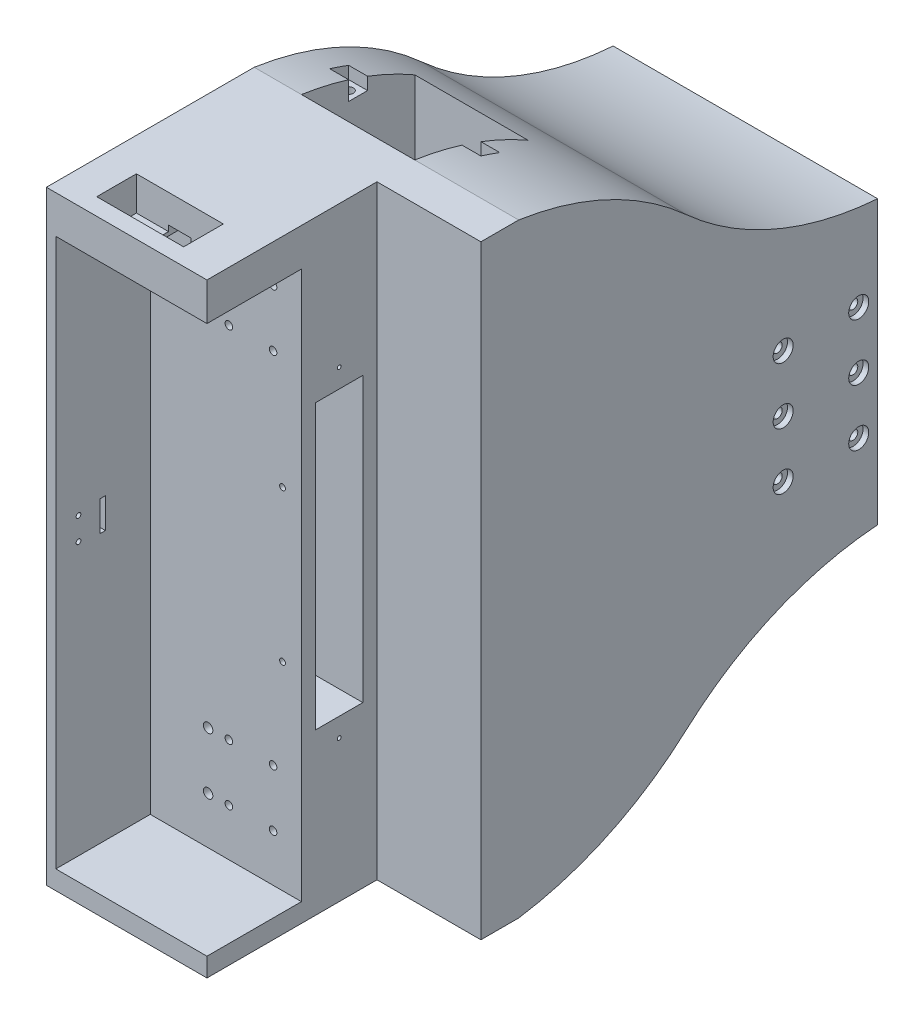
from build123d import *

# Parameters (mm, degrees)
EXTRUDE_1_DEPTH           = 320
SKETCH_3_W                = 49.99999999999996
SKETCH_3_H                = 300
CUT_EXTRUDE_1_DEPTH       = 80
SKETCH_5_R                = 1.9999999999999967
SKETCH_5_R_2              = 1.9999999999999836
CUT_EXTRUDE_2_DEPTH       = 50
SKETCH_9_R                = 2.4999999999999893
SKETCH_9_R_2              = 2.5000000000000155
SKETCH_9_R_3              = 2.5000000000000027
CUT_EXTRUDE_3_DEPTH       = 50
SKETCH_11_W               = 140
SKETCH_11_H               = 320
SKETCH_11_R               = 1.9999999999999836
SKETCH_11_R_2             = 1.9999999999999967
SKETCH_11_R_3             = 2.5000000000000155
SKETCH_11_R_4             = 2.4999999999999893
SKETCH_11_R_5             = 2.5000000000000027
EXTRUDE_3_DEPTH           = 9.999999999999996
SKETCH_12_W               = 55
SKETCH_12_H               = 320
CUT_EXTRUDE_4_DEPTH       = 9.999999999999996
EXTRUDE_4_DEPTH           = 140
CUT_EXTRUDE_START         = -85
CUT_EXTRUDE_5_DEPTH       = 60.00000000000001
CUT_EXTRUDE_6_DEPTH       = 60.00000000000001
CUT_EXTRUDE_8_DEPTH       = 61
CUT_EXTRUDE_9_DEPTH       = 396.9797974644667
CUT_EXTRUDE_9_DEPTH_BACK  = 396.9797974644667
SKETCH_19_R               = 2.5000000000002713
SKETCH_19_R_2             = 2.4999999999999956
SKETCH_19_R_3             = 2.4999999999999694
SKETCH_19_R_4             = 2.4999999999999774
CUT_EXTRUDE_10_DEPTH      = 403.4922359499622
CUT_EXTRUDE_10_DEPTH_BACK = 3
SKETCH_20_R               = 5.3
SKETCH_20_R_2             = 2.4999999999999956
SKETCH_20_R_3             = 2.4999999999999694
SKETCH_20_R_4             = 5.299999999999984
SKETCH_20_R_5             = 2.5000000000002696
CUT_EXTRUDE_START_2       = -3
SKETCH_21_R               = 5.3
SKETCH_21_R_2             = 5.299999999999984
CUT_EXTRUDE_11_DEPTH      = 3
CUT_EXTRUDE_12_DEPTH      = 71
SKETCH_23_W               = 20.000000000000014
SKETCH_23_H               = 10
CUT_EXTRUDE_13_DEPTH      = 2
SKETCH_24_W               = 3
SKETCH_24_H               = 15.999999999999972
CUT_EXTRUDE_14_DEPTH      = 12
SKETCH_25_R               = 1.2499999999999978
CUT_EXTRUDE_15_DEPTH      = 12
EXTRUDE_5_DEPTH           = 10
CUT_EXTRUDE_16_DEPTH      = 18
CUT_EXTRUDE_17_DEPTH      = 10
SKETCH_30_W               = 11.999999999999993
SKETCH_30_H               = 9.999999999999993
CUT_EXTRUDE_18_DEPTH      = 5
EXTRUDE_6_DEPTH           = 10
CUT_EXTRUDE_19_DEPTH      = 18
SKETCH_33_W               = 11.999999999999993
SKETCH_33_H               = 15.000000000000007
CUT_EXTRUDE_20_DEPTH      = 5
EXTRUDE_7_DEPTH           = 20
CUT_EXTRUDE_21_DEPTH      = 10
SKETCH_36_R               = 1.0000000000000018
CUT_EXTRUDE_22_DEPTH      = 20
SKETCH_37_R               = 1.5499999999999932
CUT_EXTRUDE_23_DEPTH      = 20
CUT_EXTRUDE_START_3       = -95
CUT_EXTRUDE_24_DEPTH      = 80
SKETCH_39_R               = 2.499999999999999
SKETCH_39_R_2             = 2.5000000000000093
CUT_EXTRUDE_25_DEPTH      = 19.999999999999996
CUT_EXTRUDE_START_4       = -19.999999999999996
SKETCH_40_R               = 2.5000000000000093
SKETCH_40_R_2             = 2.5000000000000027
CUT_EXTRUDE_26_DEPTH      = 19.999999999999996


with BuildPart() as part:
    # Sketch 1 → Extrude 1 (new body)
    with BuildSketch(Plane(origin=(0, 0, 0), x_dir=(1, 0, 0), z_dir=(0, 1, 0))):
        Polygon((0, 0), (140, 0), (140, -19.999999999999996), (85, -19.99999999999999), (85.00000000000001, -99.99999999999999), (0, -100), align=None)
    extrude(amount=EXTRUDE_1_DEPTH)

    # Sketch 3 → Cut-Extrude 1 (cut)
    with BuildSketch(Plane(origin=(85, 0, -1.475e-14), x_dir=(-1.7e-16, 0, -1), z_dir=(1, 0, -1.7e-16))):
        with Locations((-75.00000000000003, 160)):
            Rectangle(SKETCH_3_W, SKETCH_3_H)
    extrude(amount=-CUT_EXTRUDE_1_DEPTH, mode=Mode.SUBTRACT)

    # Sketch 5 → Cut-Extrude 2 (cut)
    with BuildSketch(Plane.XY.offset(50.00000000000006)):
        with Locations((46.59999999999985, 64.99999999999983)):
            Circle(SKETCH_5_R)
        with Locations((69.99999999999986, 65)):
            Circle(SKETCH_5_R)
        with Locations((46.59999999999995, 34.99999999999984)):
            Circle(SKETCH_5_R)
        with BuildLine():
            ThreePointArc((71.99999999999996, 35), (68.58578643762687, 36.41421356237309), (69.99999999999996, 33))
            Line((69.99999999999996, 33), (69.99999999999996, 35))
            Line((69.99999999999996, 35), (71.99999999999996, 35))
        make_face()
        with BuildLine():
            Line((69.99999999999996, 35), (69.99999999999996, 33))
            ThreePointArc((69.99999999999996, 33), (71.41421356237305, 33.58578643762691), (71.99999999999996, 35))
            Line((71.99999999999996, 35), (69.99999999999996, 35))
        make_face()
        with BuildLine():
            ThreePointArc((71.99999999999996, 35), (68.58578643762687, 36.41421356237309), (69.99999999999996, 33))
            Line((69.99999999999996, 33), (69.99999999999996, 35))
            Line((69.99999999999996, 35), (71.99999999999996, 35))
        make_face()
        with BuildLine():
            Line((69.99999999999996, 35), (69.99999999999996, 33))
            ThreePointArc((69.99999999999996, 33), (71.41421356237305, 33.58578643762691), (71.99999999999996, 35))
            Line((71.99999999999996, 35), (69.99999999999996, 35))
        make_face()
        with Locations((69.9999999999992, 255)):
            Circle(SKETCH_5_R_2)
        with Locations((46.59999999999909, 284.99999999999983)):
            Circle(SKETCH_5_R)
        with Locations((69.9999999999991, 285)):
            Circle(SKETCH_5_R)
        with Locations((46.5999999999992, 254.99999999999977)):
            Circle(SKETCH_5_R_2)
    extrude(amount=-CUT_EXTRUDE_2_DEPTH, mode=Mode.SUBTRACT)

    # Sketch 9 → Cut-Extrude 3 (cut)
    with BuildSketch(Plane.XY.offset(50.00000000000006)):
        with Locations((35.59999999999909, 284.9999999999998)):
            Circle(SKETCH_9_R)
        with Locations((35.5999999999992, 254.99999999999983)):
            Circle(SKETCH_9_R_2)
        with Locations((35.59999999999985, 64.99999999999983)):
            Circle(SKETCH_9_R_3)
        with Locations((35.59999999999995, 34.99999999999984)):
            Circle(SKETCH_9_R_3)
    extrude(amount=-CUT_EXTRUDE_3_DEPTH, mode=Mode.SUBTRACT)

    # Sketch 11 → Extrude 3 (add)
    with BuildSketch(Plane(origin=(0, 0, 0), x_dir=(-1, 0, 0), z_dir=(0, 0, -1))):
        with Locations((-70, 160)):
            Rectangle(SKETCH_11_W, SKETCH_11_H)
        with Locations(Location((-46.599999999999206, 254.99999999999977, 0), (0, 0, 180))):
            Circle(SKETCH_11_R, mode=Mode.SUBTRACT)
        with Locations(Location((-69.99999999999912, 285, 0), (0, 0, 180))):
            Circle(SKETCH_11_R_2, mode=Mode.SUBTRACT)
        with Locations(Location((-46.5999999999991, 284.99999999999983, 0), (0, 0, 180))):
            Circle(SKETCH_11_R_2, mode=Mode.SUBTRACT)
        with Locations(Location((-69.99999999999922, 255, 0), (0, 0, 180))):
            Circle(SKETCH_11_R, mode=Mode.SUBTRACT)
        with Locations(Location((-35.599999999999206, 254.99999999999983, 0), (0, 0, 180))):
            Circle(SKETCH_11_R_3, mode=Mode.SUBTRACT)
        with Locations(Location((-35.5999999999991, 284.9999999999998, 0), (0, 0, 180))):
            Circle(SKETCH_11_R_4, mode=Mode.SUBTRACT)
        with Locations(Location((-35.59999999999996, 34.99999999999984, 0), (0, 0, 180))):
            Circle(SKETCH_11_R_5, mode=Mode.SUBTRACT)
        with Locations(Location((-35.59999999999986, 64.99999999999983, 0), (0, 0, 180))):
            Circle(SKETCH_11_R_5, mode=Mode.SUBTRACT)
        with Locations(Location((-46.59999999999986, 64.99999999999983, 0), (0, 0, 180))):
            Circle(SKETCH_11_R_2, mode=Mode.SUBTRACT)
        with Locations(Location((-46.59999999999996, 34.99999999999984, 0), (0, 0, 180))):
            Circle(SKETCH_11_R_2, mode=Mode.SUBTRACT)
        with Locations(Location((-69.99999999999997, 35, 0), (0, 0, 180))):
            Circle(SKETCH_11_R_2, mode=Mode.SUBTRACT)
        with Locations(Location((-69.99999999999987, 65, 0), (0, 0, 180))):
            Circle(SKETCH_11_R_2, mode=Mode.SUBTRACT)
    extrude(amount=EXTRUDE_3_DEPTH)

    # Sketch 12 → Cut-Extrude 4 (cut)
    with BuildSketch(Plane.XY.offset(19.99999999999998)):
        with Locations((112.5, 160)):
            Rectangle(SKETCH_12_W, SKETCH_12_H)
    extrude(amount=-CUT_EXTRUDE_4_DEPTH, mode=Mode.SUBTRACT)

    # Sketch 13 → Extrude 4 (add)
    with BuildSketch(Plane(origin=(140, 0, 0), x_dir=(0, 0, -1), z_dir=(1, 0, 0))):
        with BuildLine():
            ThreePointArc((9.999999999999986, -2.842e-14), (57.53221582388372, 14.427226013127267), (98.8479943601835, 42.003716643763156))
            ThreePointArc((98.8479943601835, 42.003716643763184), (145.80719719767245, 72.08646557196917), (200, 85.24999999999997))
            Line((200, 85.24999999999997), (200, 234.75))
            ThreePointArc((200, 234.75), (145.80719719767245, 247.9135344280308), (98.8479943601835, 277.9962833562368))
            ThreePointArc((98.84799436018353, 277.9962833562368), (57.532215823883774, 305.5727739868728), (9.999999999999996, 320.00000000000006))
            Line((9.999999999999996, 320), (9.999999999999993, 0))
        make_face()
    extrude(amount=-EXTRUDE_4_DEPTH)

    # Sketch 15 → Cut-Extrude 5 (cut)
    with BuildSketch(Plane.ZY.offset(CUT_EXTRUDE_START)):
        with BuildLine():
            ThreePointArc((-69.99999999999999, 20.96770904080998), (-40.990712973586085, 7.648886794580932), (-10.000000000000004, -5.684e-14))
            Line((-9.999999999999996, 0), (-9.999999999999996, 80))
            Line((-9.999999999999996, 80), (-70, 79.99999999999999))
            Line((-70, 79.99999999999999), (-70, 20.967709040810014))
        make_face()
        with BuildLine():
            Line((-9.999999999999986, 240), (-9.999999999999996, 320))
            ThreePointArc((-10, 320), (-40.99071297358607, 312.3511132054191), (-69.99999999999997, 299.03229095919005))
            Line((-69.99999999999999, 299.03229095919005), (-69.99999999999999, 240))
            Line((-69.99999999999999, 240), (-9.999999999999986, 240))
        make_face()
    extrude(amount=CUT_EXTRUDE_5_DEPTH, mode=Mode.SUBTRACT)

    # Sketch 16 → Cut-Extrude 6 (cut)
    with BuildSketch(Plane(origin=(85, 0, -1.475e-14), x_dir=(-1.7e-16, 0, -1), z_dir=(1, 0, -1.7e-16))):
        Polygon((-42.500000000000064, 235), (-42.500000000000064, 160), (-17.500000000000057, 160), (-17.500000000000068, 235), align=None)
        Polygon((-17.500000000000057, 160), (-42.50000000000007, 160), (-42.500000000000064, 85.00000000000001), (-17.500000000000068, 85.00000000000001), align=None)
    extrude(amount=-CUT_EXTRUDE_6_DEPTH, mode=Mode.SUBTRACT)

    # Sketch 17 → Cut-Extrude 8 (cut)
    with BuildSketch(Plane(origin=(0, 0, -200), x_dir=(-1, 0, 0), z_dir=(0, 0, -1))):
        Polygon((-20.000000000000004, 204.74999999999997), (-19.99999999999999, 115.24999999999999), (-120, 115.24999999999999), (-120.00000000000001, 204.75), align=None)
    extrude(amount=-CUT_EXTRUDE_8_DEPTH, mode=Mode.SUBTRACT)

    # Sketch 19 → Cut-Extrude 9 (cut, two sides: drawn at the far end of the back side and taken through both)
    with BuildSketch(Plane(origin=(19.99999999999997, -3.1e-15, 0), x_dir=(0, 0, -1), z_dir=(1, -1.6e-16, 0)).offset(-CUT_EXTRUDE_9_DEPTH_BACK)):
        with Locations(Location((189.9999999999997, 160.00000000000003, 0), (0, 0, 90))):
            Circle(SKETCH_19_R)
        with Locations(Location((150, 159.9999999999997, 0), (0, 0, 90))):
            Circle(SKETCH_19_R_2)
        with Locations(Location((149.99999999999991, 189.9999999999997, 0), (0, 0, 90))):
            Circle(SKETCH_19_R_3)
        with Locations(Location((189.9999999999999, 189.99999999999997, 0), (0, 0, 90))):
            Circle(SKETCH_19_R_2)
        with Locations(Location((149.99999999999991, 130.0000000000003, 0), (0, 0, 90))):
            Circle(SKETCH_19_R_4)
        with Locations(Location((189.99999999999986, 129.99999999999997, 0), (0, 0, 90))):
            Circle(SKETCH_19_R_2)
    extrude(amount=CUT_EXTRUDE_9_DEPTH + CUT_EXTRUDE_9_DEPTH_BACK, mode=Mode.SUBTRACT)

    # Sketch 20 → Cut-Extrude 10 (cut, two sides: drawn at the far end of the back side and taken through both)
    # profile 1 of 6: a face of its own
    with BuildSketch(Plane(origin=(140, 0, 0), x_dir=(0, 0, -1), z_dir=(1, 0, 0)).offset(-CUT_EXTRUDE_10_DEPTH_BACK)):
        with Locations(Location((189.9999999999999, 189.99999999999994, 0), (0, 0, 180))):
            Circle(SKETCH_20_R)
        with Locations(Location((189.9999999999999, 189.99999999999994, 0), (0, 0, 90))):
            Circle(SKETCH_20_R_2, mode=Mode.SUBTRACT)
    # profile 2 of 6: a face of its own
    with BuildSketch(Plane(origin=(140, 0, 0), x_dir=(0, 0, -1), z_dir=(1, 0, 0)).offset(-CUT_EXTRUDE_10_DEPTH_BACK)):
        with Locations(Location((149.99999999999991, 189.99999999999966, 0), (0, 0, 180))):
            Circle(SKETCH_20_R)
        with Locations(Location((149.99999999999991, 189.99999999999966, 0), (0, 0, 90))):
            Circle(SKETCH_20_R_3, mode=Mode.SUBTRACT)
    # profile 3 of 6: a face of its own
    with BuildSketch(Plane(origin=(140, 0, 0), x_dir=(0, 0, -1), z_dir=(1, 0, 0)).offset(-CUT_EXTRUDE_10_DEPTH_BACK)):
        with Locations(Location((150, 159.99999999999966, 0), (0, 0, 180))):
            Circle(SKETCH_20_R)
        with Locations(Location((150, 159.99999999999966, 0), (0, 0, 90))):
            Circle(SKETCH_20_R_2, mode=Mode.SUBTRACT)
    # profile 4 of 6: a face of its own
    with BuildSketch(Plane(origin=(140, 0, 0), x_dir=(0, 0, -1), z_dir=(1, 0, 0)).offset(-CUT_EXTRUDE_10_DEPTH_BACK)):
        with Locations(Location((189.9999999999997, 160, 0), (0, 0, 180))):
            Circle(SKETCH_20_R_4)
        with Locations(Location((189.9999999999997, 160, 0), (0, 0, 90))):
            Circle(SKETCH_20_R_5, mode=Mode.SUBTRACT)
    # profile 5 of 6: a face of its own
    with BuildSketch(Plane(origin=(140, 0, 0), x_dir=(0, 0, -1), z_dir=(1, 0, 0)).offset(-CUT_EXTRUDE_10_DEPTH_BACK)):
        with Locations(Location((189.99999999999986, 129.99999999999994, 0), (0, 0, 180))):
            Circle(SKETCH_20_R)
        with Locations(Location((189.99999999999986, 129.99999999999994, 0), (0, 0, 90))):
            Circle(SKETCH_20_R_2, mode=Mode.SUBTRACT)
    # profile 6 of 6: a face of its own
    with BuildSketch(Plane(origin=(140, 0, 0), x_dir=(0, 0, -1), z_dir=(1, 0, 0)).offset(-CUT_EXTRUDE_10_DEPTH_BACK)):
        with Locations(Location((149.99999999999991, 130.00000000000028, 0), (0, 0, 180))):
            Circle(SKETCH_20_R)
        with Locations(Location((149.99999999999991, 130.00000000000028, 0), (0, 0, 90))):
            Circle(SKETCH_20_R_3, mode=Mode.SUBTRACT)
    extrude(amount=CUT_EXTRUDE_10_DEPTH + CUT_EXTRUDE_10_DEPTH_BACK, mode=Mode.SUBTRACT)

    # Sketch 21 → Cut-Extrude 11 (cut)
    with BuildSketch(Plane.ZY.offset(CUT_EXTRUDE_START_2)):
        with Locations((-150, 159.99999999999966)):
            Circle(SKETCH_21_R)
        with Locations((-149.99999999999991, 130.00000000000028)):
            Circle(SKETCH_21_R)
        with Locations((-149.99999999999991, 189.99999999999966)):
            Circle(SKETCH_21_R)
        with Locations((-189.9999999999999, 189.99999999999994)):
            Circle(SKETCH_21_R)
        with Locations((-189.9999999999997, 160)):
            Circle(SKETCH_21_R_2)
        with Locations((-189.99999999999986, 129.99999999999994)):
            Circle(SKETCH_21_R)
    extrude(amount=CUT_EXTRUDE_11_DEPTH, mode=Mode.SUBTRACT)

    # Sketch 22 → Cut-Extrude 12 (cut)
    with BuildSketch(Plane(origin=(0, 0, -139), x_dir=(-1, 0, 0), z_dir=(0, 0, -1))):
        Polygon((-69.99999999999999, 159.99999999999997), (-70, 195.49999999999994), (-105.49999999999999, 195.49999999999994), (-105.49999999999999, 160), align=None)
        Polygon((-34.499999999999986, 195.49999999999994), (-70, 195.49999999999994), (-69.99999999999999, 159.99999999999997), (-34.499999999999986, 159.99999999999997), align=None)
        Polygon((-34.499999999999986, 159.99999999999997), (-70, 159.99999999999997), (-69.99999999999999, 124.49999999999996), (-34.49999999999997, 124.49999999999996), align=None)
        Polygon((-69.99999999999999, 124.49999999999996), (-69.99999999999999, 159.99999999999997), (-105.49999999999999, 160), (-105.49999999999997, 124.49999999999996), align=None)
    extrude(amount=-CUT_EXTRUDE_12_DEPTH, mode=Mode.SUBTRACT)

    # Sketch 23 → Cut-Extrude 13 (cut)
    with BuildSketch(Plane.ZY):
        with Locations((80, 155)):
            Rectangle(SKETCH_23_W, SKETCH_23_H)
        with Locations((80, 165)):
            Rectangle(SKETCH_23_W, SKETCH_23_H)
    extrude(amount=-CUT_EXTRUDE_13_DEPTH, mode=Mode.SUBTRACT)

    # Sketch 24 → Cut-Extrude 14 (cut)
    with BuildSketch(Plane.ZY.offset(-2)):
        with Locations((75.25000000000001, 160)):
            Rectangle(SKETCH_24_W, SKETCH_24_H)
    extrude(amount=-CUT_EXTRUDE_14_DEPTH, mode=Mode.SUBTRACT)

    # Sketch 25 → Cut-Extrude 15 (cut)
    with BuildSketch(Plane.ZY.offset(-2)):
        with Locations((88.00000000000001, 166)):
            Circle(SKETCH_25_R)
        with Locations((88.00000000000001, 154)):
            Circle(SKETCH_25_R)
    extrude(amount=-CUT_EXTRUDE_15_DEPTH, mode=Mode.SUBTRACT)

    # Sketch 26 → Extrude 5 (add)
    with BuildSketch(Plane(origin=(0, 10, 0), x_dir=(1, 0, 0), z_dir=(0, 1, 0))):
        Polygon((85.00000000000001, -99.99999999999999), (85.00000000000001, -50.00000000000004), (5.000000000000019, -50.00000000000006), (5.000000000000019, -100), align=None)
    extrude(amount=EXTRUDE_5_DEPTH)

    # Sketch 28 → Cut-Extrude 16 (cut)
    with BuildSketch(Plane.XZ):
        Polygon((63.66212190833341, 70.00000000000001), (63.66212190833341, 91), (40.662121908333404, 90.99999999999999), (17.662121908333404, 91.00000000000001), (17.66212190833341, 70), align=None)
    extrude(amount=-CUT_EXTRUDE_16_DEPTH, mode=Mode.SUBTRACT)

    # Sketch 29 → Cut-Extrude 17 (cut)
    with BuildSketch(Plane.XZ.offset(-18)):
        Polygon((34.66212190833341, 70), (40.66212190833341, 70), (46.66212190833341, 70.00000000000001), (46.66212190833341, 75.00000000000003), (34.66212190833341, 75.00000000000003), align=None)
    extrude(amount=-CUT_EXTRUDE_17_DEPTH, mode=Mode.SUBTRACT)

    # Sketch 30 → Cut-Extrude 18 (cut)
    with BuildSketch(Plane(origin=(0, 20, 0), x_dir=(1, 0, 0), z_dir=(0, 1, 0))):
        with Locations((40.662121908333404, -65.00000000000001)):
            Rectangle(SKETCH_30_W, SKETCH_30_H)
    extrude(amount=-CUT_EXTRUDE_18_DEPTH, mode=Mode.SUBTRACT)

    # Sketch 31 → Extrude 6 (add)
    with BuildSketch(Plane.XZ.offset(-310)):
        Polygon((85, 50.00000000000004), (85.00000000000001, 99.99999999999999), (5.000000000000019, 100), (5.000000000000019, 50.00000000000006), align=None)
    extrude(amount=EXTRUDE_6_DEPTH)

    # Sketch 32 → Cut-Extrude 19 (cut)
    with BuildSketch(Plane(origin=(0, 320, 0), x_dir=(1, 0, 0), z_dir=(0, 1, 0))):
        Polygon((17.662121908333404, -91.00000000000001), (17.66212190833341, -70), (63.66212190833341, -70.00000000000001), (63.66212190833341, -91), align=None)
    extrude(amount=-CUT_EXTRUDE_19_DEPTH, mode=Mode.SUBTRACT)

    # Sketch 33 → Cut-Extrude 20 (cut)
    with BuildSketch(Plane.XZ.offset(-300)):
        with Locations((40.662121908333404, 67.50000000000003)):
            Rectangle(SKETCH_33_W, SKETCH_33_H)
    extrude(amount=-CUT_EXTRUDE_20_DEPTH, mode=Mode.SUBTRACT)

    # Sketch 34 → Extrude 7 (add)
    with BuildSketch(Plane(origin=(0, 20, 0), x_dir=(1, 0, 0), z_dir=(0, 1, 0))):
        Polygon((5.000000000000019, -100), (85.00000000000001, -99.99999999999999), (85.00000000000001, -50.00000000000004), (5.000000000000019, -50.00000000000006), align=None)
    extrude(amount=-EXTRUDE_7_DEPTH)

    # Sketch 35 → Cut-Extrude 21 (cut)
    with BuildSketch(Plane(origin=(0, 20, 0), x_dir=(1, 0, 0), z_dir=(0, 1, 0))):
        Polygon((5.000000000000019, -100), (85.00000000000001, -99.99999999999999), (85.00000000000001, -50.00000000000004), (5.000000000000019, -50.00000000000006), align=None)
    extrude(amount=-CUT_EXTRUDE_21_DEPTH, mode=Mode.SUBTRACT)

    # Sketch 36 → Cut-Extrude 22 (cut)
    with BuildSketch(Plane(origin=(85, 0, -1.475e-14), x_dir=(-1.7e-16, 0, -1), z_dir=(1, 0, -1.7e-16))):
        with Locations((-30.000000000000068, 245)):
            Circle(SKETCH_36_R)
        with Locations((-30.000000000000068, 75.00000000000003)):
            Circle(SKETCH_36_R)
    extrude(amount=-CUT_EXTRUDE_22_DEPTH, mode=Mode.SUBTRACT)

    # Sketch 37 → Cut-Extrude 23 (cut)
    with BuildSketch(Plane.XY.offset(50.00000000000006)):
        with Locations((75.00000000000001, 195)):
            Circle(SKETCH_37_R)
        with Locations(Location((75.00000000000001, 114.99999999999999, 0), (0, 0, 180))):
            Circle(SKETCH_37_R)
    extrude(amount=-CUT_EXTRUDE_23_DEPTH, mode=Mode.SUBTRACT)

    # Sketch 38 → Cut-Extrude 24 (cut)
    with BuildSketch(Plane.ZY.offset(CUT_EXTRUDE_START_3)):
        with BuildLine():
            Line((-34.99999999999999, 304.32000000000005), (-34.99999999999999, 314.32048256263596))
            ThreePointArc((-34.999999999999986, 314.3204825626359), (-40.02670153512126, 312.684749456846), (-44.99999999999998, 310.89319887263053))
            Line((-44.99999999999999, 310.89319887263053), (-44.99999999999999, 304.32000000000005))
            Line((-44.99999999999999, 304.32000000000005), (-34.99999999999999, 304.32000000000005))
        make_face()
        with BuildLine():
            ThreePointArc((-44.99999999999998, 9.106801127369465), (-40.026701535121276, 7.315250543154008), (-35, 5.679517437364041))
            Line((-34.99999999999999, 5.679517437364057), (-34.99999999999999, 15.679999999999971))
            Line((-34.99999999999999, 15.679999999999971), (-44.99999999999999, 15.679999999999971))
            Line((-44.99999999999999, 15.679999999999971), (-44.99999999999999, 9.106801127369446))
        make_face()
    extrude(amount=CUT_EXTRUDE_24_DEPTH, mode=Mode.SUBTRACT)

    # Sketch 39 → Cut-Extrude 25 (cut)
    with BuildSketch(Plane.XZ.offset(-15.679999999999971)):
        with Locations(Location((19.999999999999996, -39.99999999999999, 0), (0, 0, 270))):
            Circle(SKETCH_39_R)
        with Locations(Location((90.00000000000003, -39.99999999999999, 0), (0, 0, 90))):
            Circle(SKETCH_39_R_2)
    extrude(amount=-CUT_EXTRUDE_25_DEPTH, mode=Mode.SUBTRACT)

    # Sketch 40 → Cut-Extrude 26 (cut)
    with BuildSketch(Plane(origin=(0, 304.32000000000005, 0), x_dir=(1, 0, 0), z_dir=(0, 1, 0)).offset(CUT_EXTRUDE_START_4)):
        with Locations(Location((90.00000000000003, 39.99999999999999, 0), (0, 0, 270))):
            Circle(SKETCH_40_R)
        with Locations(Location((19.999999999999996, 39.99999999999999, 0), (0, 0, 90))):
            Circle(SKETCH_40_R_2)
    extrude(amount=CUT_EXTRUDE_26_DEPTH, mode=Mode.SUBTRACT)


solid = part.part
